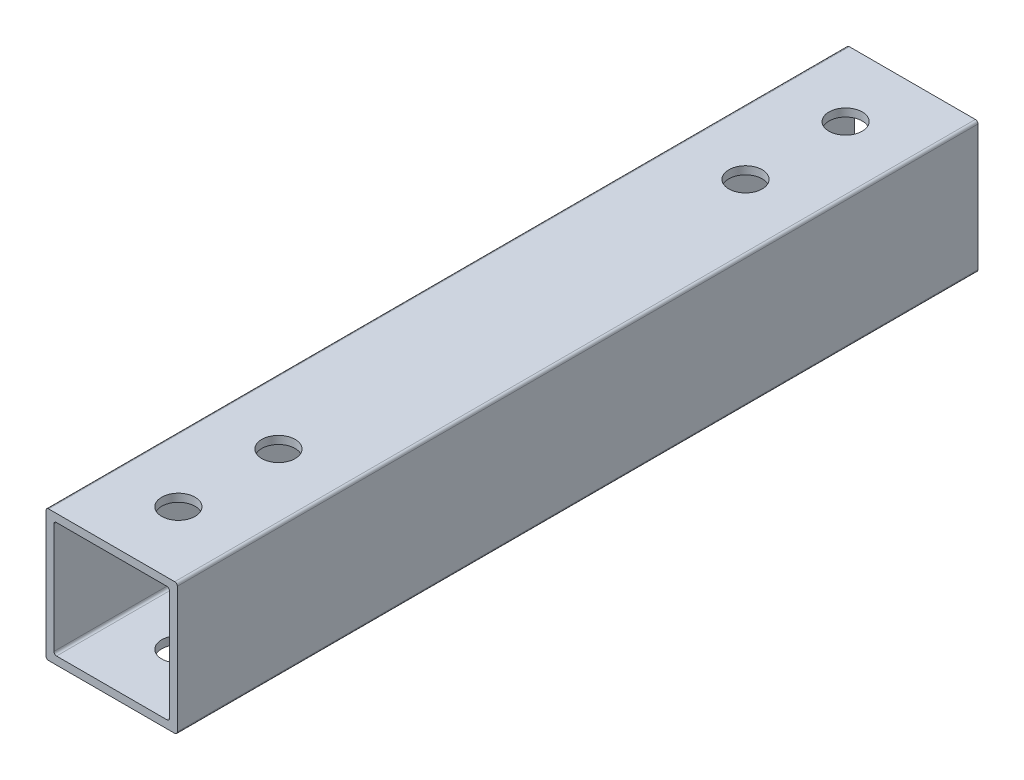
from build123d import *

# Parameters (mm, degrees)
BOSS_EXTRUDE1_DEPTH = 152.4
CUT_EXTRUDE1_REACH  = 2002.195
SKETCH2_R           = 3.175


with BuildPart() as part:
    # Sketch1 → Boss-Extrude1 (new body)
    with BuildSketch(Plane(origin=(0, 0, -2000), x_dir=(-1, 0, 0), z_dir=(0, 0, -1))):
        with BuildLine():
            Line((12.5, -12), (12.5, 12))
            ThreePointArc((12.5, 12), (12.353553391, 12.353553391), (12, 12.5))
            Line((12, 12.5), (-12, 12.5))
            ThreePointArc((-12, 12.5), (-12.353553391, 12.353553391), (-12.5, 12))
            Line((-12.5, 12), (-12.5, -12))
            ThreePointArc((-12.5, -12), (-12.353553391, -12.353553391), (-12, -12.5))
            Line((-12, -12.5), (12, -12.5))
            ThreePointArc((12, -12.5), (12.353553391, -12.353553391), (12.5, -12))
        make_face()
        with BuildLine():
            Line((11, 10.5), (11, -10.5))
            ThreePointArc((11, -10.5), (10.853553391, -10.853553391), (10.5, -11))
            Line((10.5, -11), (-10.5, -11))
            ThreePointArc((-10.5, -11), (-10.853553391, -10.853553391), (-11, -10.5))
            Line((-11, -10.5), (-11, 10.5))
            ThreePointArc((-11, 10.5), (-10.853553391, 10.853553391), (-10.5, 11))
            Line((-10.5, 11), (10.5, 11))
            ThreePointArc((10.5, 11), (10.853553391, 10.853553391), (11, 10.5))
        make_face(mode=Mode.SUBTRACT)
    extrude(amount=-BOSS_EXTRUDE1_DEPTH)

    # Cut-Extrude1: up to this face of the body (flat: up to its plane)
    cut_extrude1_end = Plane(part.part.faces().sort_by_distance((0, -12.5, -1923.8))[0])
    # Sketch2 → Cut-Extrude1 (cut, up to the picked face)
    with BuildSketch(Plane(origin=(0, 12.5, 0), x_dir=(1, 0, 0), z_dir=(0, 1, 0)), mode=Mode.PRIVATE) as cut_extrude1_sk1:
        with Locations(Location((0, 1860.3, 0), (0, 0, 180))):
            Circle(SKETCH2_R)
    cut_extrude1_tool1 = split(extrude(cut_extrude1_sk1.sketch, amount=-CUT_EXTRUDE1_REACH, mode=Mode.PRIVATE), bisect_by=cut_extrude1_end, keep=Keep.BOTH, mode=Mode.PRIVATE)
    # Sketch2 → Cut-Extrude1 (cut, up to the picked face)
    with BuildSketch(Plane(origin=(0, 12.5, 0), x_dir=(1, 0, 0), z_dir=(0, 1, 0)), mode=Mode.PRIVATE) as cut_extrude1_sk2:
        with Locations(Location((0, 1879.35, 0), (0, 0, 180))):
            Circle(SKETCH2_R)
    cut_extrude1_tool2 = split(extrude(cut_extrude1_sk2.sketch, amount=-CUT_EXTRUDE1_REACH, mode=Mode.PRIVATE), bisect_by=cut_extrude1_end, keep=Keep.BOTH, mode=Mode.PRIVATE)
    # Sketch2 → Cut-Extrude1 (cut, up to the picked face)
    with BuildSketch(Plane(origin=(0, 12.5, 0), x_dir=(1, 0, 0), z_dir=(0, 1, 0)), mode=Mode.PRIVATE) as cut_extrude1_sk3:
        with Locations(Location((0, 1987.3, 0), (0, 0, 180))):
            Circle(SKETCH2_R)
    cut_extrude1_tool3 = split(extrude(cut_extrude1_sk3.sketch, amount=-CUT_EXTRUDE1_REACH, mode=Mode.PRIVATE), bisect_by=cut_extrude1_end, keep=Keep.BOTH, mode=Mode.PRIVATE)
    # Sketch2 → Cut-Extrude1 (cut, up to the picked face)
    with BuildSketch(Plane(origin=(0, 12.5, 0), x_dir=(1, 0, 0), z_dir=(0, 1, 0)), mode=Mode.PRIVATE) as cut_extrude1_sk4:
        with Locations(Location((0, 1968.25, 0), (0, 0, 180))):
            Circle(SKETCH2_R)
    cut_extrude1_tool4 = split(extrude(cut_extrude1_sk4.sketch, amount=-CUT_EXTRUDE1_REACH, mode=Mode.PRIVATE), bisect_by=cut_extrude1_end, keep=Keep.BOTH, mode=Mode.PRIVATE)
    add(cut_extrude1_tool1.solids().sort_by(Axis((0, 12.5, -1860.3), (0, -1, 0)))[0], mode=Mode.SUBTRACT)
    add(cut_extrude1_tool2.solids().sort_by(Axis((0, 12.5, -1879.35), (0, -1, 0)))[0], mode=Mode.SUBTRACT)
    add(cut_extrude1_tool3.solids().sort_by(Axis((0, 12.5, -1987.3), (0, -1, 0)))[0], mode=Mode.SUBTRACT)
    add(cut_extrude1_tool4.solids().sort_by(Axis((0, 12.5, -1968.25), (0, -1, 0)))[0], mode=Mode.SUBTRACT)


solid = part.part
